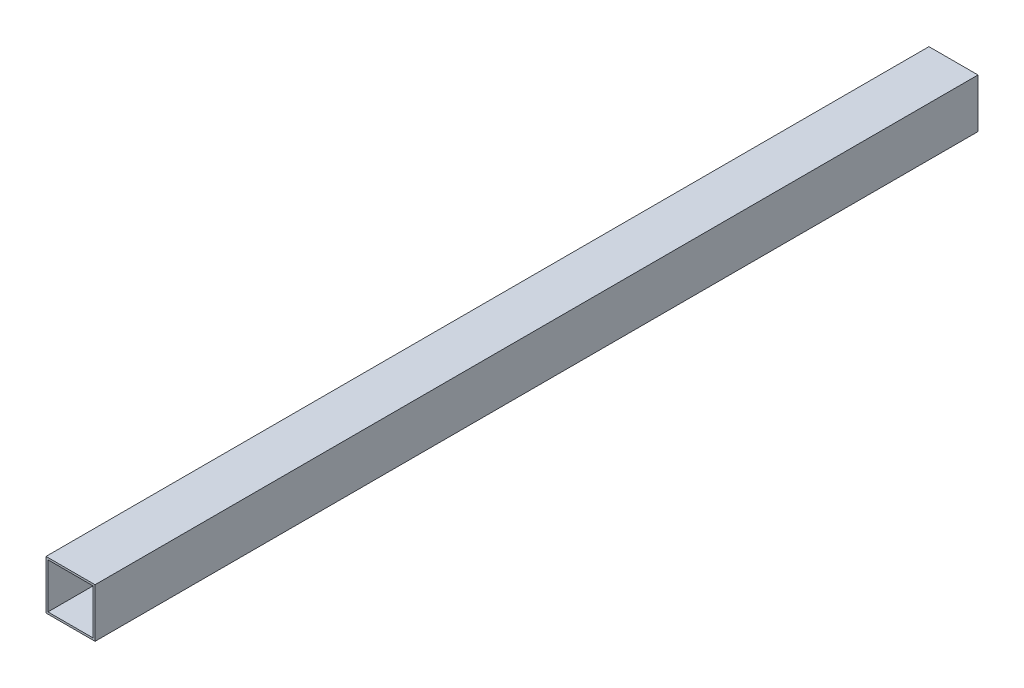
ISO-10303-21;
HEADER;
FILE_DESCRIPTION(('STEP AP214'),'2;1');
FILE_NAME('part.step','',(''),(''),'','','');
FILE_SCHEMA(('AUTOMOTIVE_DESIGN { 1 0 10303 214 1 1 1 1 }'));
ENDSEC;
DATA;
#1=APPLICATION_CONTEXT('core data for automotive mechanical design processes');
#2=APPLICATION_PROTOCOL_DEFINITION('international standard','automotive_design',2000,#1);
#3=PRODUCT_CONTEXT('',#1,'mechanical');
#4=PRODUCT('Part','Part','',(#3));
#5=PRODUCT_RELATED_PRODUCT_CATEGORY('part','',(#4));
#6=PRODUCT_DEFINITION_FORMATION('','',#4);
#7=PRODUCT_DEFINITION_CONTEXT('part definition',#1,'design');
#8=PRODUCT_DEFINITION('design','',#6,#7);
#9=PRODUCT_DEFINITION_SHAPE('','',#8);
#10=(LENGTH_UNIT() NAMED_UNIT(*) SI_UNIT(.MILLI.,.METRE.));
#11=(NAMED_UNIT(*) PLANE_ANGLE_UNIT() SI_UNIT($,.RADIAN.));
#12=(NAMED_UNIT(*) SI_UNIT($,.STERADIAN.) SOLID_ANGLE_UNIT());
#13=UNCERTAINTY_MEASURE_WITH_UNIT(LENGTH_MEASURE(1.E-05),#10,'distance_accuracy_value','');
#14=(GEOMETRIC_REPRESENTATION_CONTEXT(3) GLOBAL_UNCERTAINTY_ASSIGNED_CONTEXT((#13)) GLOBAL_UNIT_ASSIGNED_CONTEXT((#10,
#11,#12)) REPRESENTATION_CONTEXT('',''));
#15=CARTESIAN_POINT('',(0.,0.,0.));
#16=DIRECTION('',(0.,0.,1.));
#17=DIRECTION('',(1.,0.,0.));
#18=AXIS2_PLACEMENT_3D('',#15,#16,#17);
#19=CARTESIAN_POINT('',(0.,0.,900.));
#20=DIRECTION('',(0.,0.,1.));
#21=DIRECTION('',(1.,0.,0.));
#22=AXIS2_PLACEMENT_3D('',#19,#20,#21);
#23=PLANE('',#22);
#24=DIRECTION('',(0.,1.,0.));
#25=VECTOR('',#24,1.);
#26=CARTESIAN_POINT('',(25.,-25.,900.));
#27=LINE('',#26,#25);
#28=CARTESIAN_POINT('',(25.,-25.,900.));
#29=VERTEX_POINT('',#28);
#30=CARTESIAN_POINT('',(25.,25.,900.));
#31=VERTEX_POINT('',#30);
#32=EDGE_CURVE('E162',#29,#31,#27,.T.);
#33=ORIENTED_EDGE('',*,*,#32,.T.);
#34=DIRECTION('',(-1.,0.,0.));
#35=VECTOR('',#34,1.);
#36=CARTESIAN_POINT('',(-25.,25.,900.));
#37=LINE('',#36,#35);
#38=CARTESIAN_POINT('',(-25.,25.,900.));
#39=VERTEX_POINT('',#38);
#40=EDGE_CURVE('E165',#31,#39,#37,.T.);
#41=ORIENTED_EDGE('',*,*,#40,.T.);
#42=DIRECTION('',(0.,-1.,0.));
#43=VECTOR('',#42,1.);
#44=CARTESIAN_POINT('',(-25.,-25.,900.));
#45=LINE('',#44,#43);
#46=CARTESIAN_POINT('',(-25.,-25.,900.));
#47=VERTEX_POINT('',#46);
#48=EDGE_CURVE('E168',#39,#47,#45,.T.);
#49=ORIENTED_EDGE('',*,*,#48,.T.);
#50=DIRECTION('',(1.,0.,0.));
#51=VECTOR('',#50,1.);
#52=CARTESIAN_POINT('',(-25.,-25.,900.));
#53=LINE('',#52,#51);
#54=EDGE_CURVE('E170',#47,#29,#53,.T.);
#55=ORIENTED_EDGE('',*,*,#54,.T.);
#56=EDGE_LOOP('',(#33,#41,#49,#55));
#57=FACE_BOUND('',#56,.T.);
#58=DIRECTION('',(-1.,0.,0.));
#59=VECTOR('',#58,1.);
#60=CARTESIAN_POINT('',(0.,23.,900.));
#61=LINE('',#60,#59);
#62=CARTESIAN_POINT('',(23.,23.,900.));
#63=VERTEX_POINT('',#62);
#64=CARTESIAN_POINT('',(-23.,23.,900.));
#65=VERTEX_POINT('',#64);
#66=EDGE_CURVE('E134',#63,#65,#61,.T.);
#67=ORIENTED_EDGE('',*,*,#66,.F.);
#68=DIRECTION('',(0.,1.,0.));
#69=VECTOR('',#68,1.);
#70=CARTESIAN_POINT('',(23.,0.,900.));
#71=LINE('',#70,#69);
#72=CARTESIAN_POINT('',(23.,-23.,900.));
#73=VERTEX_POINT('',#72);
#74=EDGE_CURVE('E126',#73,#63,#71,.T.);
#75=ORIENTED_EDGE('',*,*,#74,.F.);
#76=DIRECTION('',(1.,0.,0.));
#77=VECTOR('',#76,1.);
#78=CARTESIAN_POINT('',(0.,-23.,900.));
#79=LINE('',#78,#77);
#80=CARTESIAN_POINT('',(-23.,-23.,900.));
#81=VERTEX_POINT('',#80);
#82=EDGE_CURVE('E148',#81,#73,#79,.T.);
#83=ORIENTED_EDGE('',*,*,#82,.F.);
#84=DIRECTION('',(0.,-1.,0.));
#85=VECTOR('',#84,1.);
#86=CARTESIAN_POINT('',(-23.,0.,900.));
#87=LINE('',#86,#85);
#88=EDGE_CURVE('E146',#65,#81,#87,.T.);
#89=ORIENTED_EDGE('',*,*,#88,.F.);
#90=EDGE_LOOP('',(#67,#75,#83,#89));
#91=FACE_BOUND('',#90,.T.);
#92=ADVANCED_FACE('F61',(#57,#91),#23,.T.);
#93=CARTESIAN_POINT('',(0.,0.,0.));
#94=DIRECTION('',(0.,0.,1.));
#95=DIRECTION('',(1.,0.,0.));
#96=AXIS2_PLACEMENT_3D('',#93,#94,#95);
#97=PLANE('',#96);
#98=DIRECTION('',(0.,1.,0.));
#99=VECTOR('',#98,1.);
#100=CARTESIAN_POINT('',(25.,-25.,0.));
#101=LINE('',#100,#99);
#102=CARTESIAN_POINT('',(25.,-25.,0.));
#103=VERTEX_POINT('',#102);
#104=CARTESIAN_POINT('',(25.,25.,0.));
#105=VERTEX_POINT('',#104);
#106=EDGE_CURVE('E142',#103,#105,#101,.T.);
#107=ORIENTED_EDGE('',*,*,#106,.F.);
#108=DIRECTION('',(1.,0.,0.));
#109=VECTOR('',#108,1.);
#110=CARTESIAN_POINT('',(-25.,-25.,0.));
#111=LINE('',#110,#109);
#112=CARTESIAN_POINT('',(-25.,-25.,0.));
#113=VERTEX_POINT('',#112);
#114=EDGE_CURVE('E166',#113,#103,#111,.T.);
#115=ORIENTED_EDGE('',*,*,#114,.F.);
#116=DIRECTION('',(0.,-1.,0.));
#117=VECTOR('',#116,1.);
#118=CARTESIAN_POINT('',(-25.,-25.,0.));
#119=LINE('',#118,#117);
#120=CARTESIAN_POINT('',(-25.,25.,0.));
#121=VERTEX_POINT('',#120);
#122=EDGE_CURVE('E177',#121,#113,#119,.T.);
#123=ORIENTED_EDGE('',*,*,#122,.F.);
#124=DIRECTION('',(-1.,0.,0.));
#125=VECTOR('',#124,1.);
#126=CARTESIAN_POINT('',(-25.,25.,0.));
#127=LINE('',#126,#125);
#128=EDGE_CURVE('E175',#105,#121,#127,.T.);
#129=ORIENTED_EDGE('',*,*,#128,.F.);
#130=EDGE_LOOP('',(#107,#115,#123,#129));
#131=FACE_BOUND('',#130,.T.);
#132=DIRECTION('',(0.,1.,0.));
#133=VECTOR('',#132,1.);
#134=CARTESIAN_POINT('',(23.,0.,0.));
#135=LINE('',#134,#133);
#136=CARTESIAN_POINT('',(23.,-23.,0.));
#137=VERTEX_POINT('',#136);
#138=CARTESIAN_POINT('',(23.,23.,0.));
#139=VERTEX_POINT('',#138);
#140=EDGE_CURVE('E84',#137,#139,#135,.T.);
#141=ORIENTED_EDGE('',*,*,#140,.T.);
#142=DIRECTION('',(-1.,0.,0.));
#143=VECTOR('',#142,1.);
#144=CARTESIAN_POINT('',(0.,23.,0.));
#145=LINE('',#144,#143);
#146=CARTESIAN_POINT('',(-23.,23.,0.));
#147=VERTEX_POINT('',#146);
#148=EDGE_CURVE('E141',#139,#147,#145,.T.);
#149=ORIENTED_EDGE('',*,*,#148,.T.);
#150=DIRECTION('',(0.,-1.,0.));
#151=VECTOR('',#150,1.);
#152=CARTESIAN_POINT('',(-23.,0.,0.));
#153=LINE('',#152,#151);
#154=CARTESIAN_POINT('',(-23.,-23.,0.));
#155=VERTEX_POINT('',#154);
#156=EDGE_CURVE('E154',#147,#155,#153,.T.);
#157=ORIENTED_EDGE('',*,*,#156,.T.);
#158=DIRECTION('',(1.,0.,0.));
#159=VECTOR('',#158,1.);
#160=CARTESIAN_POINT('',(0.,-23.,0.));
#161=LINE('',#160,#159);
#162=EDGE_CURVE('E135',#155,#137,#161,.T.);
#163=ORIENTED_EDGE('',*,*,#162,.T.);
#164=EDGE_LOOP('',(#141,#149,#157,#163));
#165=FACE_BOUND('',#164,.T.);
#166=ADVANCED_FACE('F195',(#131,#165),#97,.F.);
#167=CARTESIAN_POINT('',(25.,-25.,900.));
#168=DIRECTION('',(-1.,0.,0.));
#169=DIRECTION('',(0.,0.,1.));
#170=AXIS2_PLACEMENT_3D('',#167,#168,#169);
#171=PLANE('',#170);
#172=ORIENTED_EDGE('',*,*,#106,.T.);
#173=DIRECTION('',(0.,0.,-1.));
#174=VECTOR('',#173,1.);
#175=CARTESIAN_POINT('',(25.,25.,900.));
#176=LINE('',#175,#174);
#177=EDGE_CURVE('E12',#31,#105,#176,.T.);
#178=ORIENTED_EDGE('',*,*,#177,.F.);
#179=ORIENTED_EDGE('',*,*,#32,.F.);
#180=DIRECTION('',(0.,0.,-1.));
#181=VECTOR('',#180,1.);
#182=CARTESIAN_POINT('',(25.,-25.,900.));
#183=LINE('',#182,#181);
#184=EDGE_CURVE('E172',#29,#103,#183,.T.);
#185=ORIENTED_EDGE('',*,*,#184,.T.);
#186=EDGE_LOOP('',(#172,#178,#179,#185));
#187=FACE_BOUND('',#186,.T.);
#188=ADVANCED_FACE('F63',(#187),#171,.F.);
#189=CARTESIAN_POINT('',(-25.,25.,900.));
#190=DIRECTION('',(0.,-1.,0.));
#191=DIRECTION('',(0.,0.,-1.));
#192=AXIS2_PLACEMENT_3D('',#189,#190,#191);
#193=PLANE('',#192);
#194=ORIENTED_EDGE('',*,*,#128,.T.);
#195=DIRECTION('',(0.,0.,-1.));
#196=VECTOR('',#195,1.);
#197=CARTESIAN_POINT('',(-25.,25.,900.));
#198=LINE('',#197,#196);
#199=EDGE_CURVE('E69',#39,#121,#198,.T.);
#200=ORIENTED_EDGE('',*,*,#199,.F.);
#201=ORIENTED_EDGE('',*,*,#40,.F.);
#202=ORIENTED_EDGE('',*,*,#177,.T.);
#203=EDGE_LOOP('',(#194,#200,#201,#202));
#204=FACE_BOUND('',#203,.T.);
#205=ADVANCED_FACE('F205',(#204),#193,.F.);
#206=CARTESIAN_POINT('',(-25.,-25.,900.));
#207=DIRECTION('',(1.,0.,0.));
#208=DIRECTION('',(0.,0.,-1.));
#209=AXIS2_PLACEMENT_3D('',#206,#207,#208);
#210=PLANE('',#209);
#211=ORIENTED_EDGE('',*,*,#122,.T.);
#212=DIRECTION('',(0.,0.,-1.));
#213=VECTOR('',#212,1.);
#214=CARTESIAN_POINT('',(-25.,-25.,900.));
#215=LINE('',#214,#213);
#216=EDGE_CURVE('E182',#47,#113,#215,.T.);
#217=ORIENTED_EDGE('',*,*,#216,.F.);
#218=ORIENTED_EDGE('',*,*,#48,.F.);
#219=ORIENTED_EDGE('',*,*,#199,.T.);
#220=EDGE_LOOP('',(#211,#217,#218,#219));
#221=FACE_BOUND('',#220,.T.);
#222=ADVANCED_FACE('F189',(#221),#210,.F.);
#223=CARTESIAN_POINT('',(-25.,-25.,900.));
#224=DIRECTION('',(0.,1.,0.));
#225=DIRECTION('',(0.,0.,1.));
#226=AXIS2_PLACEMENT_3D('',#223,#224,#225);
#227=PLANE('',#226);
#228=ORIENTED_EDGE('',*,*,#114,.T.);
#229=ORIENTED_EDGE('',*,*,#184,.F.);
#230=ORIENTED_EDGE('',*,*,#54,.F.);
#231=ORIENTED_EDGE('',*,*,#216,.T.);
#232=EDGE_LOOP('',(#228,#229,#230,#231));
#233=FACE_BOUND('',#232,.T.);
#234=ADVANCED_FACE('F199',(#233),#227,.F.);
#235=CARTESIAN_POINT('',(23.,0.,900.));
#236=DIRECTION('',(-1.,0.,0.));
#237=DIRECTION('',(0.,0.,1.));
#238=AXIS2_PLACEMENT_3D('',#235,#236,#237);
#239=PLANE('',#238);
#240=ORIENTED_EDGE('',*,*,#140,.F.);
#241=DIRECTION('',(0.,0.,-1.));
#242=VECTOR('',#241,1.);
#243=CARTESIAN_POINT('',(23.,-23.,900.));
#244=LINE('',#243,#242);
#245=EDGE_CURVE('E130',#73,#137,#244,.T.);
#246=ORIENTED_EDGE('',*,*,#245,.F.);
#247=ORIENTED_EDGE('',*,*,#74,.T.);
#248=DIRECTION('',(0.,0.,-1.));
#249=VECTOR('',#248,1.);
#250=CARTESIAN_POINT('',(23.,23.,900.));
#251=LINE('',#250,#249);
#252=EDGE_CURVE('E129',#63,#139,#251,.T.);
#253=ORIENTED_EDGE('',*,*,#252,.T.);
#254=EDGE_LOOP('',(#240,#246,#247,#253));
#255=FACE_BOUND('',#254,.T.);
#256=ADVANCED_FACE('F128',(#255),#239,.T.);
#257=CARTESIAN_POINT('',(0.,23.,900.));
#258=DIRECTION('',(0.,-1.,0.));
#259=DIRECTION('',(0.,0.,-1.));
#260=AXIS2_PLACEMENT_3D('',#257,#258,#259);
#261=PLANE('',#260);
#262=ORIENTED_EDGE('',*,*,#148,.F.);
#263=ORIENTED_EDGE('',*,*,#252,.F.);
#264=ORIENTED_EDGE('',*,*,#66,.T.);
#265=DIRECTION('',(0.,0.,-1.));
#266=VECTOR('',#265,1.);
#267=CARTESIAN_POINT('',(-23.,23.,900.));
#268=LINE('',#267,#266);
#269=EDGE_CURVE('E143',#65,#147,#268,.T.);
#270=ORIENTED_EDGE('',*,*,#269,.T.);
#271=EDGE_LOOP('',(#262,#263,#264,#270));
#272=FACE_BOUND('',#271,.T.);
#273=ADVANCED_FACE('F138',(#272),#261,.T.);
#274=CARTESIAN_POINT('',(-23.,0.,900.));
#275=DIRECTION('',(1.,0.,0.));
#276=DIRECTION('',(0.,0.,-1.));
#277=AXIS2_PLACEMENT_3D('',#274,#275,#276);
#278=PLANE('',#277);
#279=ORIENTED_EDGE('',*,*,#156,.F.);
#280=ORIENTED_EDGE('',*,*,#269,.F.);
#281=ORIENTED_EDGE('',*,*,#88,.T.);
#282=DIRECTION('',(0.,0.,-1.));
#283=VECTOR('',#282,1.);
#284=CARTESIAN_POINT('',(-23.,-23.,900.));
#285=LINE('',#284,#283);
#286=EDGE_CURVE('E76',#81,#155,#285,.T.);
#287=ORIENTED_EDGE('',*,*,#286,.T.);
#288=EDGE_LOOP('',(#279,#280,#281,#287));
#289=FACE_BOUND('',#288,.T.);
#290=ADVANCED_FACE('F228',(#289),#278,.T.);
#291=CARTESIAN_POINT('',(0.,-23.,900.));
#292=DIRECTION('',(0.,1.,0.));
#293=DIRECTION('',(0.,0.,1.));
#294=AXIS2_PLACEMENT_3D('',#291,#292,#293);
#295=PLANE('',#294);
#296=ORIENTED_EDGE('',*,*,#162,.F.);
#297=ORIENTED_EDGE('',*,*,#286,.F.);
#298=ORIENTED_EDGE('',*,*,#82,.T.);
#299=ORIENTED_EDGE('',*,*,#245,.T.);
#300=EDGE_LOOP('',(#296,#297,#298,#299));
#301=FACE_BOUND('',#300,.T.);
#302=ADVANCED_FACE('F232',(#301),#295,.T.);
#303=CLOSED_SHELL('',(#92,#166,#188,#205,#222,#234,#256,#273,#290,#302));
#304=MANIFOLD_SOLID_BREP('B2',#303);
#305=ADVANCED_BREP_SHAPE_REPRESENTATION('',(#18,#304),#14);
#306=SHAPE_DEFINITION_REPRESENTATION(#9,#305);
ENDSEC;
END-ISO-10303-21;
